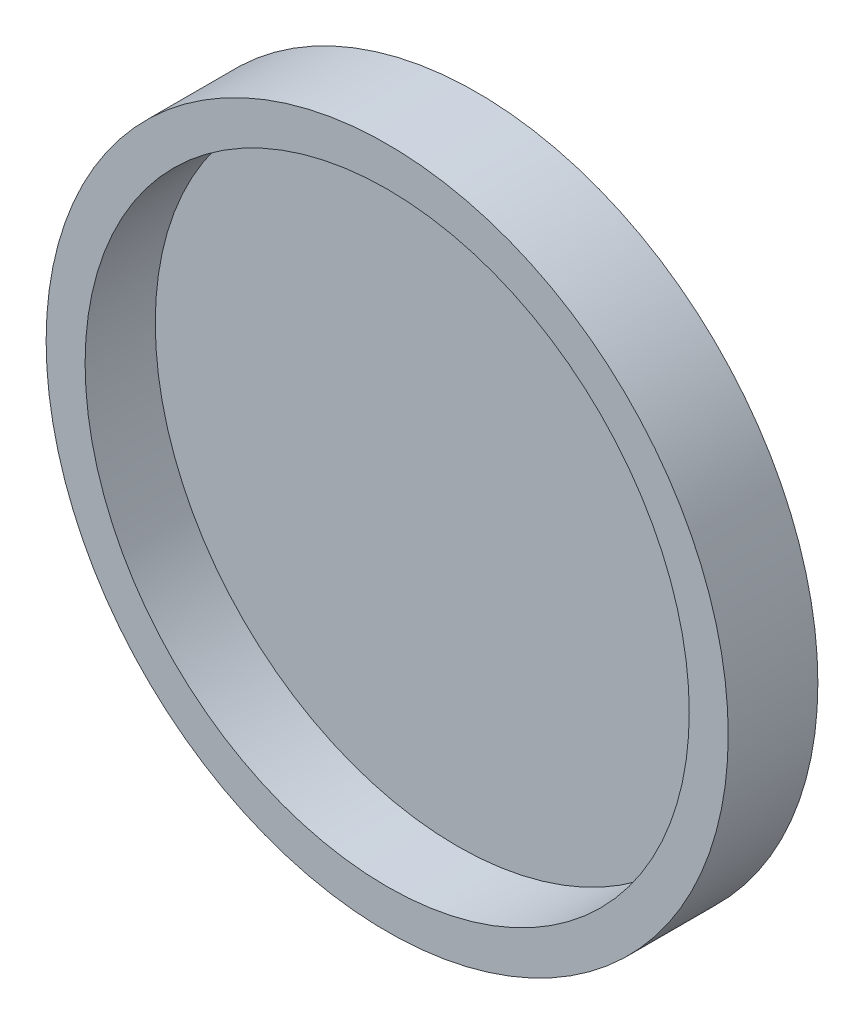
ISO-10303-21;
HEADER;
FILE_DESCRIPTION(('STEP AP214'),'2;1');
FILE_NAME('part.step','',(''),(''),'','','');
FILE_SCHEMA(('AUTOMOTIVE_DESIGN { 1 0 10303 214 1 1 1 1 }'));
ENDSEC;
DATA;
#1=APPLICATION_CONTEXT('core data for automotive mechanical design processes');
#2=APPLICATION_PROTOCOL_DEFINITION('international standard','automotive_design',2000,#1);
#3=PRODUCT_CONTEXT('',#1,'mechanical');
#4=PRODUCT('Part','Part','',(#3));
#5=PRODUCT_RELATED_PRODUCT_CATEGORY('part','',(#4));
#6=PRODUCT_DEFINITION_FORMATION('','',#4);
#7=PRODUCT_DEFINITION_CONTEXT('part definition',#1,'design');
#8=PRODUCT_DEFINITION('design','',#6,#7);
#9=PRODUCT_DEFINITION_SHAPE('','',#8);
#10=(LENGTH_UNIT() NAMED_UNIT(*) SI_UNIT(.MILLI.,.METRE.));
#11=(NAMED_UNIT(*) PLANE_ANGLE_UNIT() SI_UNIT($,.RADIAN.));
#12=(NAMED_UNIT(*) SI_UNIT($,.STERADIAN.) SOLID_ANGLE_UNIT());
#13=UNCERTAINTY_MEASURE_WITH_UNIT(LENGTH_MEASURE(1.E-05),#10,'distance_accuracy_value','');
#14=(GEOMETRIC_REPRESENTATION_CONTEXT(3) GLOBAL_UNCERTAINTY_ASSIGNED_CONTEXT((#13)) GLOBAL_UNIT_ASSIGNED_CONTEXT((#10,
#11,#12)) REPRESENTATION_CONTEXT('',''));
#15=CARTESIAN_POINT('',(0.,0.,0.));
#16=DIRECTION('',(0.,0.,1.));
#17=DIRECTION('',(1.,0.,0.));
#18=AXIS2_PLACEMENT_3D('',#15,#16,#17);
#19=CARTESIAN_POINT('',(0.,0.,4.6));
#20=DIRECTION('',(0.,0.,-1.));
#21=DIRECTION('',(-1.,0.,0.));
#22=AXIS2_PLACEMENT_3D('',#19,#20,#21);
#23=CYLINDRICAL_SURFACE('',#22,17.5);
#24=CARTESIAN_POINT('',(0.,0.,4.6));
#25=DIRECTION('',(0.,0.,1.));
#26=DIRECTION('',(1.,0.,0.));
#27=AXIS2_PLACEMENT_3D('',#24,#25,#26);
#28=CIRCLE('',#27,17.5);
#29=CARTESIAN_POINT('',(17.5,0.,4.6));
#30=VERTEX_POINT('',#29);
#31=EDGE_CURVE('E10',#30,#30,#28,.T.);
#32=ORIENTED_EDGE('',*,*,#31,.F.);
#33=EDGE_LOOP('',(#32));
#34=FACE_BOUND('',#33,.T.);
#35=CARTESIAN_POINT('',(0.,0.,0.));
#36=DIRECTION('',(0.,0.,1.));
#37=DIRECTION('',(1.,0.,0.));
#38=AXIS2_PLACEMENT_3D('',#35,#36,#37);
#39=CIRCLE('',#38,17.5);
#40=CARTESIAN_POINT('',(17.5,0.,0.));
#41=VERTEX_POINT('',#40);
#42=EDGE_CURVE('E40',#41,#41,#39,.T.);
#43=ORIENTED_EDGE('',*,*,#42,.T.);
#44=EDGE_LOOP('',(#43));
#45=FACE_BOUND('',#44,.T.);
#46=ADVANCED_FACE('F37',(#34,#45),#23,.T.);
#47=CARTESIAN_POINT('',(0.,0.,4.6));
#48=DIRECTION('',(0.,0.,1.));
#49=DIRECTION('',(1.,0.,0.));
#50=AXIS2_PLACEMENT_3D('',#47,#48,#49);
#51=PLANE('',#50);
#52=CARTESIAN_POINT('',(0.,0.,4.6));
#53=DIRECTION('',(0.,0.,1.));
#54=DIRECTION('',(1.,0.,0.));
#55=AXIS2_PLACEMENT_3D('',#52,#53,#54);
#56=CIRCLE('',#55,15.5);
#57=CARTESIAN_POINT('',(15.5,0.,4.6));
#58=VERTEX_POINT('',#57);
#59=EDGE_CURVE('E49',#58,#58,#56,.T.);
#60=ORIENTED_EDGE('',*,*,#59,.F.);
#61=EDGE_LOOP('',(#60));
#62=FACE_BOUND('',#61,.T.);
#63=ORIENTED_EDGE('',*,*,#31,.T.);
#64=EDGE_LOOP('',(#63));
#65=FACE_BOUND('',#64,.T.);
#66=ADVANCED_FACE('F64',(#62,#65),#51,.T.);
#67=CARTESIAN_POINT('',(0.,0.,0.));
#68=DIRECTION('',(0.,0.,1.));
#69=DIRECTION('',(1.,0.,0.));
#70=AXIS2_PLACEMENT_3D('',#67,#68,#69);
#71=PLANE('',#70);
#72=ORIENTED_EDGE('',*,*,#42,.F.);
#73=EDGE_LOOP('',(#72));
#74=FACE_BOUND('',#73,.T.);
#75=ADVANCED_FACE('F60',(#74),#71,.F.);
#76=CARTESIAN_POINT('',(0.,0.,1.));
#77=DIRECTION('',(0.,0.,1.));
#78=DIRECTION('',(1.,0.,0.));
#79=AXIS2_PLACEMENT_3D('',#76,#77,#78);
#80=CYLINDRICAL_SURFACE('',#79,15.5);
#81=CARTESIAN_POINT('',(0.,0.,1.));
#82=DIRECTION('',(0.,0.,1.));
#83=DIRECTION('',(1.,0.,0.));
#84=AXIS2_PLACEMENT_3D('',#81,#82,#83);
#85=CIRCLE('',#84,15.5);
#86=CARTESIAN_POINT('',(15.5,0.,1.));
#87=VERTEX_POINT('',#86);
#88=EDGE_CURVE('E47',#87,#87,#85,.T.);
#89=ORIENTED_EDGE('',*,*,#88,.F.);
#90=EDGE_LOOP('',(#89));
#91=FACE_BOUND('',#90,.T.);
#92=ORIENTED_EDGE('',*,*,#59,.T.);
#93=EDGE_LOOP('',(#92));
#94=FACE_BOUND('',#93,.T.);
#95=ADVANCED_FACE('F57',(#91,#94),#80,.F.);
#96=CARTESIAN_POINT('',(0.,0.,1.));
#97=DIRECTION('',(0.,0.,1.));
#98=DIRECTION('',(1.,0.,0.));
#99=AXIS2_PLACEMENT_3D('',#96,#97,#98);
#100=PLANE('',#99);
#101=ORIENTED_EDGE('',*,*,#88,.T.);
#102=EDGE_LOOP('',(#101));
#103=FACE_BOUND('',#102,.T.);
#104=ADVANCED_FACE('F55',(#103),#100,.T.);
#105=CLOSED_SHELL('',(#46,#66,#75,#95,#104));
#106=MANIFOLD_SOLID_BREP('B2',#105);
#107=ADVANCED_BREP_SHAPE_REPRESENTATION('',(#18,#106),#14);
#108=SHAPE_DEFINITION_REPRESENTATION(#9,#107);
ENDSEC;
END-ISO-10303-21;
